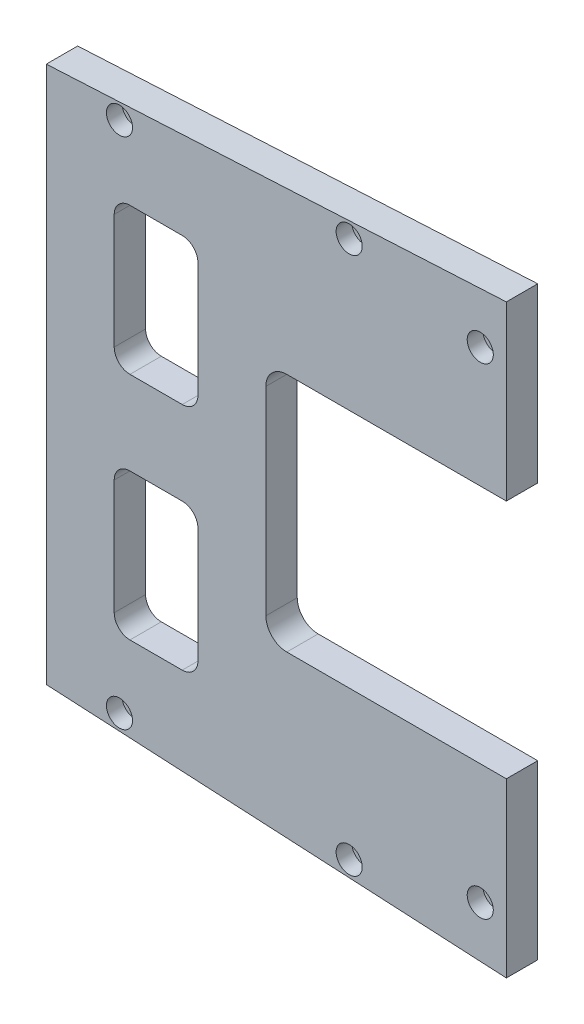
from build123d import *

# Parameters (mm, degrees)
BOSS_EXTRUDE1_DEPTH = 9.525
FILLET1_R           = 6.35
SKETCH4_R           = 2.3876
CUT_EXTRUDE2_DEPTH  = 12.7
CUT_EXTRUDE3_START  = 4.7752
SKETCH5_R           = 3.9624
CUT_EXTRUDE3_DEPTH  = 12.7
SKETCH6_R           = 2.3876
CUT_EXTRUDE4_DEPTH  = 20.32
CUT_EXTRUDE5_START  = 4.7752
SKETCH7_R           = 3.9624
CUT_EXTRUDE5_DEPTH  = 20.32
SKETCH8_W           = 25.4254
SKETCH8_H           = 44.45
CUT_EXTRUDE6_DEPTH  = 20.32
FILLET3_R           = 4.7752


with BuildPart() as part:
    # Sketch2 → Boss-Extrude1 (new body)
    with BuildSketch(Plane.XY):
        Polygon((139.7, -88.9), (0, -81.578633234), (0, 0), (0, 81.578633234), (139.7, 88.9), (139.7, 36.5125), (66.675, 36.5125), (66.675, -36.5125), (139.7, -36.5125), align=None)
    extrude(amount=BOSS_EXTRUDE1_DEPTH)

    # Fillet1
    fillet1_edges = [part.edges().sort_by_distance(p)[0] for p in [
        (66.675, 36.5125, 4.7625),
        (66.675, -36.5125, 4.7625),
    ]]
    fillet(fillet1_edges, radius=FILLET1_R)

    # Sketch4 → Cut-Extrude2 (cut)
    with BuildSketch(Plane.XY):
        with Locations(Location((131.7752, 73.025, 0), (0, 0, 180))):
            Circle(SKETCH4_R)
        with Locations(Location((131.7752, -73.025, 0), (0, 0, 180))):
            Circle(SKETCH4_R)
    extrude(amount=CUT_EXTRUDE2_DEPTH, mode=Mode.SUBTRACT)

    # Sketch5 → Cut-Extrude3 (cut)
    with BuildSketch(Plane.XY.offset(CUT_EXTRUDE3_START)):
        with Locations(Location((131.7752, -73.025, 0), (0, 0, 180))):
            Circle(SKETCH5_R)
        with Locations(Location((131.7752, 73.025, 0), (0, 0, 180))):
            Circle(SKETCH5_R)
    extrude(amount=CUT_EXTRUDE3_DEPTH, mode=Mode.SUBTRACT)

    # Sketch6 → Cut-Extrude4 (cut)
    with BuildSketch(Plane.XY):
        with Locations(Location((22.225, 77.961642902, 0), (0, 0, 180))):
            Circle(SKETCH6_R)
        with Locations(Location((91.979273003, 81.617309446, 0), (0, 0, 180))):
            Circle(SKETCH6_R)
        with Locations(Location((22.225, -77.961642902, 0), (0, 0, 180))):
            Circle(SKETCH6_R)
        with Locations(Location((91.979273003, -81.617309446, 0), (0, 0, 180))):
            Circle(SKETCH6_R)
    extrude(amount=CUT_EXTRUDE4_DEPTH, mode=Mode.SUBTRACT)

    # Sketch7 → Cut-Extrude5 (cut)
    with BuildSketch(Plane.XY.offset(CUT_EXTRUDE5_START)):
        with Locations(Location((22.225, 77.961642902, 0), (0, 0, 180))):
            Circle(SKETCH7_R)
        with Locations(Location((91.979273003, 81.617309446, 0), (0, 0, 180))):
            Circle(SKETCH7_R)
        with Locations(Location((91.979273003, -81.617309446, 0), (0, 0, 180))):
            Circle(SKETCH7_R)
        with Locations(Location((22.225, -77.961642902, 0), (0, 0, 180))):
            Circle(SKETCH7_R)
    extrude(amount=CUT_EXTRUDE5_DEPTH, mode=Mode.SUBTRACT)

    # Sketch8 → Cut-Extrude6 (cut)
    with BuildSketch(Plane.XY):
        with Locations((33.3375, -34.925)):
            Rectangle(SKETCH8_W, SKETCH8_H)
        with Locations((33.3375, 34.925)):
            Rectangle(SKETCH8_W, SKETCH8_H)
    extrude(amount=CUT_EXTRUDE6_DEPTH, mode=Mode.SUBTRACT)

    # Fillet3
    fillet3_edges = [part.edges().sort_by_distance(p)[0] for p in [
        (46.0502, -57.15, 4.7625),
        (46.0502, -12.7, 4.7625),
        (20.6248, -12.7, 4.7625),
        (20.6248, -57.15, 4.7625),
        (20.6248, 57.15, 4.7625),
        (20.6248, 12.7, 4.7625),
        (46.0502, 12.7, 4.7625),
        (46.0502, 57.15, 4.7625),
    ]]
    fillet(fillet3_edges, radius=FILLET3_R)


solid = part.part
